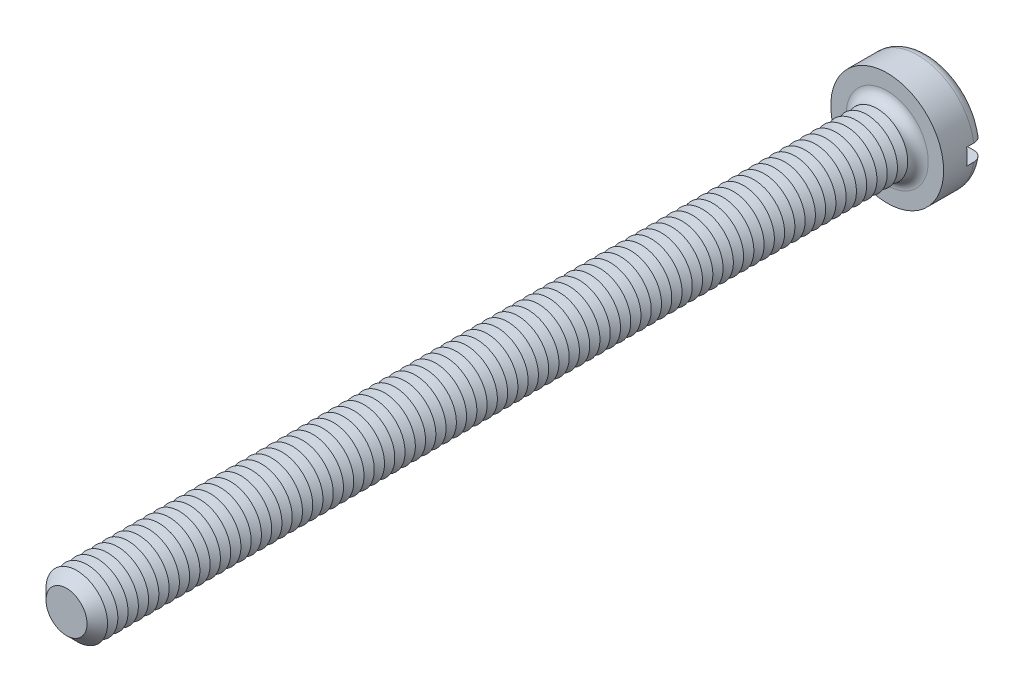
from build123d import *

# Parameters (mm, degrees)
SKETCH3_R           = 2.75
BOSS_EXTRUDE2_DEPTH = 2
SKETCH4_R           = 1.5
BOSS_EXTRUDE3_DEPTH = 40
FILLET1_R           = 0.5
CHAMFER1_SIZE       = 0.5
LPATTERN1_COUNT     = 78
LPATTERN1_PITCH     = 0.5
SKETCH8_W           = 5.5
SKETCH8_H           = 0.8
CUT_EXTRUDE1_DEPTH  = 0.85


with BuildPart() as part:
    # Sketch3 → Boss-Extrude2 (new body)
    with BuildSketch(Plane.XY):
        Circle(SKETCH3_R)
    extrude(amount=-BOSS_EXTRUDE2_DEPTH)

    # Sketch4 → Boss-Extrude3 (add)
    with BuildSketch(Plane.XY):
        Circle(SKETCH4_R)
    extrude(amount=BOSS_EXTRUDE3_DEPTH)

    # Fillet1
    fillet1_edges = [part.edges().sort_by_distance(p)[0] for p in [
        (-2.75, 0, -2),
        (-1.5, 0, 0),
    ]]
    fillet(fillet1_edges, radius=FILLET1_R)

    # Chamfer1
    chamfer1_edges = [part.edges().sort_by_distance(p)[0] for p in [
        (-1.5, 0, 40),
    ]]
    chamfer(chamfer1_edges, length=CHAMFER1_SIZE)

    # Sketch6 → Cut-Revolve1 (revolve, cut)
    with BuildSketch(Plane(origin=(0, 0, 0), x_dir=(0, 0, -1), z_dir=(1, 0, 0)), mode=Mode.PRIVATE) as cut_revolve1_sk:
        Polygon((-0.5, 1.5), (-0.75, 1.066987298), (-1, 1.5), align=None)
    cut_revolve1 = revolve(cut_revolve1_sk.sketch.rotate(Axis((0, 0, -1.694361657), (0, 0, 1)), 90), axis=Axis((0, 0, -1.694361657), (0, 0, 1)), mode=Mode.SUBTRACT)

    # LPattern1: Cut-Revolve1 ×78
    with Locations(*[(0, 0, i * LPATTERN1_PITCH) for i in range(1, LPATTERN1_COUNT)]):
        add(cut_revolve1, mode=Mode.SUBTRACT)

    # Sketch8 → Cut-Extrude1 (cut)
    with BuildSketch(Plane(origin=(0, 0, -2), x_dir=(-1, 0, 0), z_dir=(0, 0, -1))):
        Rectangle(SKETCH8_W, SKETCH8_H)
    extrude(amount=-CUT_EXTRUDE1_DEPTH, mode=Mode.SUBTRACT)


solid = part.part
